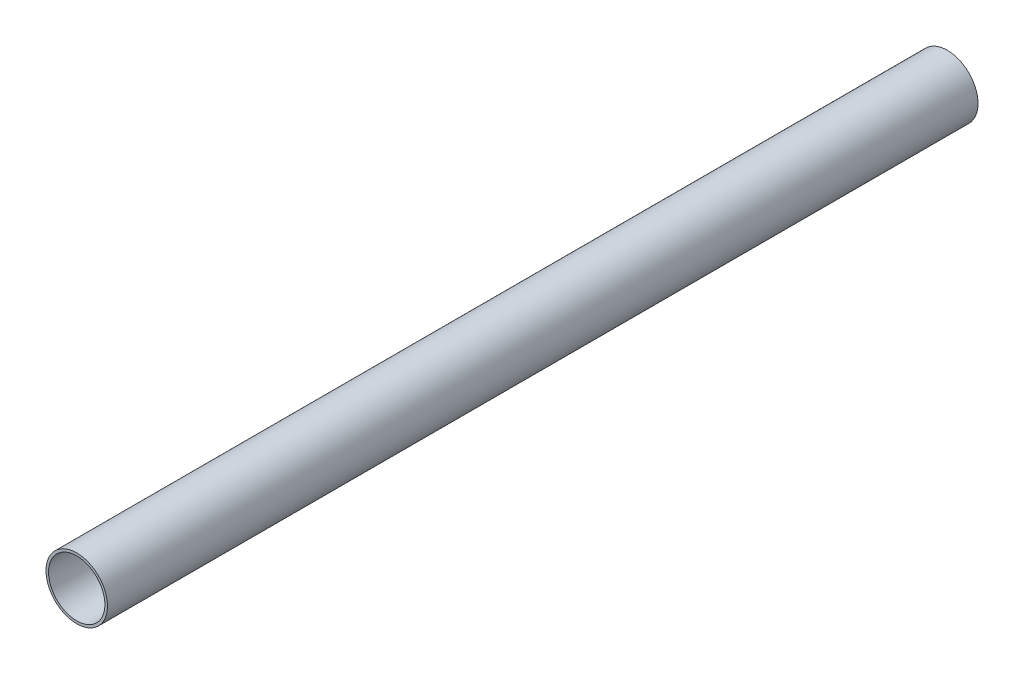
ISO-10303-21;
HEADER;
FILE_DESCRIPTION(('STEP AP214'),'2;1');
FILE_NAME('part.step','',(''),(''),'','','');
FILE_SCHEMA(('AUTOMOTIVE_DESIGN { 1 0 10303 214 1 1 1 1 }'));
ENDSEC;
DATA;
#1=APPLICATION_CONTEXT('core data for automotive mechanical design processes');
#2=APPLICATION_PROTOCOL_DEFINITION('international standard','automotive_design',2000,#1);
#3=PRODUCT_CONTEXT('',#1,'mechanical');
#4=PRODUCT('Part','Part','',(#3));
#5=PRODUCT_RELATED_PRODUCT_CATEGORY('part','',(#4));
#6=PRODUCT_DEFINITION_FORMATION('','',#4);
#7=PRODUCT_DEFINITION_CONTEXT('part definition',#1,'design');
#8=PRODUCT_DEFINITION('design','',#6,#7);
#9=PRODUCT_DEFINITION_SHAPE('','',#8);
#10=(LENGTH_UNIT() NAMED_UNIT(*) SI_UNIT(.MILLI.,.METRE.));
#11=(NAMED_UNIT(*) PLANE_ANGLE_UNIT() SI_UNIT($,.RADIAN.));
#12=(NAMED_UNIT(*) SI_UNIT($,.STERADIAN.) SOLID_ANGLE_UNIT());
#13=UNCERTAINTY_MEASURE_WITH_UNIT(LENGTH_MEASURE(1.E-05),#10,'distance_accuracy_value','');
#14=(GEOMETRIC_REPRESENTATION_CONTEXT(3) GLOBAL_UNCERTAINTY_ASSIGNED_CONTEXT((#13)) GLOBAL_UNIT_ASSIGNED_CONTEXT((#10,
#11,#12)) REPRESENTATION_CONTEXT('',''));
#15=CARTESIAN_POINT('',(0.,0.,0.));
#16=DIRECTION('',(0.,0.,1.));
#17=DIRECTION('',(1.,0.,0.));
#18=AXIS2_PLACEMENT_3D('',#15,#16,#17);
#19=CARTESIAN_POINT('',(0.,0.,425.));
#20=DIRECTION('',(0.,0.,0.999999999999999));
#21=DIRECTION('',(1.,0.,0.));
#22=AXIS2_PLACEMENT_3D('',#19,#20,#21);
#23=PLANE('',#22);
#24=CARTESIAN_POINT('',(0.,0.,425.));
#25=DIRECTION('',(0.,0.,0.999999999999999));
#26=DIRECTION('',(1.,0.,0.));
#27=AXIS2_PLACEMENT_3D('',#24,#25,#26);
#28=CIRCLE('',#27,30.);
#29=CARTESIAN_POINT('',(-30.,0.,425.));
#30=VERTEX_POINT('',#29);
#31=EDGE_CURVE('E11',#30,#30,#28,.T.);
#32=ORIENTED_EDGE('',*,*,#31,.T.);
#33=EDGE_LOOP('',(#32));
#34=FACE_BOUND('',#33,.T.);
#35=CARTESIAN_POINT('',(0.,0.,425.));
#36=DIRECTION('',(0.,0.,0.999999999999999));
#37=DIRECTION('',(1.,0.,0.));
#38=AXIS2_PLACEMENT_3D('',#35,#36,#37);
#39=CIRCLE('',#38,27.5);
#40=CARTESIAN_POINT('',(-27.5,0.,425.));
#41=VERTEX_POINT('',#40);
#42=EDGE_CURVE('E76',#41,#41,#39,.T.);
#43=ORIENTED_EDGE('',*,*,#42,.F.);
#44=EDGE_LOOP('',(#43));
#45=FACE_BOUND('',#44,.T.);
#46=ADVANCED_FACE('F62',(#34,#45),#23,.T.);
#47=CARTESIAN_POINT('',(0.,0.,-425.));
#48=DIRECTION('',(0.,0.,0.999999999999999));
#49=DIRECTION('',(1.,0.,0.));
#50=AXIS2_PLACEMENT_3D('',#47,#48,#49);
#51=PLANE('',#50);
#52=CARTESIAN_POINT('',(0.,0.,-425.));
#53=DIRECTION('',(0.,0.,0.999999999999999));
#54=DIRECTION('',(1.,0.,0.));
#55=AXIS2_PLACEMENT_3D('',#52,#53,#54);
#56=CIRCLE('',#55,30.);
#57=CARTESIAN_POINT('',(-30.,0.,-425.));
#58=VERTEX_POINT('',#57);
#59=EDGE_CURVE('E70',#58,#58,#56,.T.);
#60=ORIENTED_EDGE('',*,*,#59,.F.);
#61=EDGE_LOOP('',(#60));
#62=FACE_BOUND('',#61,.T.);
#63=CARTESIAN_POINT('',(0.,0.,-425.));
#64=DIRECTION('',(0.,0.,0.999999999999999));
#65=DIRECTION('',(1.,0.,0.));
#66=AXIS2_PLACEMENT_3D('',#63,#64,#65);
#67=CIRCLE('',#66,27.5);
#68=CARTESIAN_POINT('',(-27.5,0.,-425.));
#69=VERTEX_POINT('',#68);
#70=EDGE_CURVE('E81',#69,#69,#67,.T.);
#71=ORIENTED_EDGE('',*,*,#70,.T.);
#72=EDGE_LOOP('',(#71));
#73=FACE_BOUND('',#72,.T.);
#74=ADVANCED_FACE('F87',(#62,#73),#51,.F.);
#75=CARTESIAN_POINT('',(0.,0.,425.));
#76=DIRECTION('',(0.,0.,-0.999999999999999));
#77=DIRECTION('',(-1.,0.,0.));
#78=AXIS2_PLACEMENT_3D('',#75,#76,#77);
#79=CYLINDRICAL_SURFACE('',#78,30.);
#80=CARTESIAN_POINT('',(-30.,0.,425.));
#81=CARTESIAN_POINT('',(-30.,0.,416.145833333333));
#82=CARTESIAN_POINT('',(-30.,0.,407.291666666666));
#83=CARTESIAN_POINT('',(-30.,0.,389.583333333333));
#84=CARTESIAN_POINT('',(-30.,0.,380.729166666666));
#85=CARTESIAN_POINT('',(-30.,0.,363.020833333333));
#86=CARTESIAN_POINT('',(-30.,0.,354.166666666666));
#87=CARTESIAN_POINT('',(-30.,0.,336.458333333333));
#88=CARTESIAN_POINT('',(-30.,0.,327.604166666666));
#89=CARTESIAN_POINT('',(-30.,0.,309.895833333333));
#90=CARTESIAN_POINT('',(-30.,0.,301.041666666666));
#91=CARTESIAN_POINT('',(-30.,0.,283.333333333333));
#92=CARTESIAN_POINT('',(-30.,0.,274.479166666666));
#93=CARTESIAN_POINT('',(-30.,0.,256.770833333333));
#94=CARTESIAN_POINT('',(-30.,0.,247.916666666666));
#95=CARTESIAN_POINT('',(-30.,0.,230.208333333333));
#96=CARTESIAN_POINT('',(-30.,0.,221.354166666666));
#97=CARTESIAN_POINT('',(-30.,0.,203.645833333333));
#98=CARTESIAN_POINT('',(-30.,0.,194.791666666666));
#99=CARTESIAN_POINT('',(-30.,0.,177.083333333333));
#100=CARTESIAN_POINT('',(-30.,0.,168.229166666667));
#101=CARTESIAN_POINT('',(-30.,0.,150.520833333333));
#102=CARTESIAN_POINT('',(-30.,0.,141.666666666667));
#103=CARTESIAN_POINT('',(-30.,0.,123.958333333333));
#104=CARTESIAN_POINT('',(-30.,0.,115.104166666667));
#105=CARTESIAN_POINT('',(-30.,0.,97.3958333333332));
#106=CARTESIAN_POINT('',(-30.,0.,88.5416666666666));
#107=CARTESIAN_POINT('',(-30.,0.,70.8333333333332));
#108=CARTESIAN_POINT('',(-30.,0.,61.9791666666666));
#109=CARTESIAN_POINT('',(-30.,0.,44.2708333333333));
#110=CARTESIAN_POINT('',(-30.,0.,35.4166666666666));
#111=CARTESIAN_POINT('',(-30.,0.,17.7083333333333));
#112=CARTESIAN_POINT('',(-30.,0.,8.85416666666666));
#113=CARTESIAN_POINT('',(-30.,0.,-8.85416666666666));
#114=CARTESIAN_POINT('',(-30.,0.,-17.7083333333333));
#115=CARTESIAN_POINT('',(-30.,0.,-35.4166666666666));
#116=CARTESIAN_POINT('',(-30.,0.,-44.2708333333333));
#117=CARTESIAN_POINT('',(-30.,0.,-61.9791666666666));
#118=CARTESIAN_POINT('',(-30.,0.,-70.8333333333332));
#119=CARTESIAN_POINT('',(-30.,0.,-88.5416666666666));
#120=CARTESIAN_POINT('',(-30.,0.,-97.3958333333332));
#121=CARTESIAN_POINT('',(-30.,0.,-115.104166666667));
#122=CARTESIAN_POINT('',(-30.,0.,-123.958333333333));
#123=CARTESIAN_POINT('',(-30.,0.,-141.666666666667));
#124=CARTESIAN_POINT('',(-30.,0.,-150.520833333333));
#125=CARTESIAN_POINT('',(-30.,0.,-168.229166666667));
#126=CARTESIAN_POINT('',(-30.,0.,-177.083333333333));
#127=CARTESIAN_POINT('',(-30.,0.,-194.791666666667));
#128=CARTESIAN_POINT('',(-30.,0.,-203.645833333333));
#129=CARTESIAN_POINT('',(-30.,0.,-221.354166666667));
#130=CARTESIAN_POINT('',(-30.,0.,-230.208333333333));
#131=CARTESIAN_POINT('',(-30.,0.,-247.916666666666));
#132=CARTESIAN_POINT('',(-30.,0.,-256.770833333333));
#133=CARTESIAN_POINT('',(-30.,0.,-274.479166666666));
#134=CARTESIAN_POINT('',(-30.,0.,-283.333333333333));
#135=CARTESIAN_POINT('',(-30.,0.,-301.041666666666));
#136=CARTESIAN_POINT('',(-30.,0.,-309.895833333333));
#137=CARTESIAN_POINT('',(-30.,0.,-327.604166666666));
#138=CARTESIAN_POINT('',(-30.,0.,-336.458333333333));
#139=CARTESIAN_POINT('',(-30.,0.,-354.166666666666));
#140=CARTESIAN_POINT('',(-30.,0.,-363.020833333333));
#141=CARTESIAN_POINT('',(-30.,0.,-380.729166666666));
#142=CARTESIAN_POINT('',(-30.,0.,-389.583333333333));
#143=CARTESIAN_POINT('',(-30.,0.,-407.291666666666));
#144=CARTESIAN_POINT('',(-30.,0.,-416.145833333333));
#145=CARTESIAN_POINT('',(-30.,0.,-425.));
#146=B_SPLINE_CURVE_WITH_KNOTS('',3,(#80,#81,#82,#83,#84,#85,#86,#87,#88,#89,#90,#91,#92,#93,
#94,#95,#96,#97,#98,#99,#100,#101,#102,#103,#104,#105,#106,#107,#108,#109,#110,#111,#112,#113,
#114,#115,#116,#117,#118,#119,#120,#121,#122,#123,#124,#125,#126,#127,#128,#129,#130,#131,#132,
#133,#134,#135,#136,#137,#138,#139,#140,#141,#142,#143,#144,#145),.UNSPECIFIED.,.F.,.F.,(4,2,2,
2,2,2,2,2,2,2,2,2,2,2,2,2,2,2,2,2,2,2,2,2,2,2,2,2,2,2,2,2,4),(0.,26.5625,53.125,79.6875,106.25,
132.8125,159.375,185.9375,212.5,239.0625,265.625,292.1875,318.75,345.3125,371.875,398.4375,425.,
451.5625,478.125,504.687499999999,531.249999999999,557.8125,584.374999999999,610.937499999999,
637.5,664.062499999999,690.624999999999,717.187499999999,743.749999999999,770.312499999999,
796.874999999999,823.437499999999,849.999999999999),.UNSPECIFIED.);
#147=EDGE_CURVE('BSEAM64',#30,#58,#146,.T.);
#148=ORIENTED_EDGE('',*,*,#31,.F.);
#149=ORIENTED_EDGE('',*,*,#59,.T.);
#150=ORIENTED_EDGE('',*,*,#147,.T.);
#151=ORIENTED_EDGE('',*,*,#147,.F.);
#152=EDGE_LOOP('',(#148,#150,#149,#151));
#153=FACE_BOUND('',#152,.T.);
#154=ADVANCED_FACE('F64',(#153),#79,.T.);
#155=CARTESIAN_POINT('',(0.,0.,425.));
#156=DIRECTION('',(0.,0.,-0.999999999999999));
#157=DIRECTION('',(-1.,0.,0.));
#158=AXIS2_PLACEMENT_3D('',#155,#156,#157);
#159=CYLINDRICAL_SURFACE('',#158,27.5);
#160=CARTESIAN_POINT('',(-27.5,0.,425.));
#161=CARTESIAN_POINT('',(-27.5,0.,416.145833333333));
#162=CARTESIAN_POINT('',(-27.5,0.,407.291666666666));
#163=CARTESIAN_POINT('',(-27.5,0.,389.583333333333));
#164=CARTESIAN_POINT('',(-27.5,0.,380.729166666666));
#165=CARTESIAN_POINT('',(-27.5,0.,363.020833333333));
#166=CARTESIAN_POINT('',(-27.5,0.,354.166666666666));
#167=CARTESIAN_POINT('',(-27.5,0.,336.458333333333));
#168=CARTESIAN_POINT('',(-27.5,0.,327.604166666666));
#169=CARTESIAN_POINT('',(-27.5,0.,309.895833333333));
#170=CARTESIAN_POINT('',(-27.5,0.,301.041666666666));
#171=CARTESIAN_POINT('',(-27.5,0.,283.333333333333));
#172=CARTESIAN_POINT('',(-27.5,0.,274.479166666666));
#173=CARTESIAN_POINT('',(-27.5,0.,256.770833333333));
#174=CARTESIAN_POINT('',(-27.5,0.,247.916666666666));
#175=CARTESIAN_POINT('',(-27.5,0.,230.208333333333));
#176=CARTESIAN_POINT('',(-27.5,0.,221.354166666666));
#177=CARTESIAN_POINT('',(-27.5,0.,203.645833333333));
#178=CARTESIAN_POINT('',(-27.5,0.,194.791666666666));
#179=CARTESIAN_POINT('',(-27.5,0.,177.083333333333));
#180=CARTESIAN_POINT('',(-27.5,0.,168.229166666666));
#181=CARTESIAN_POINT('',(-27.5,0.,150.520833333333));
#182=CARTESIAN_POINT('',(-27.5,0.,141.666666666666));
#183=CARTESIAN_POINT('',(-27.5,0.,123.958333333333));
#184=CARTESIAN_POINT('',(-27.5,0.,115.104166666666));
#185=CARTESIAN_POINT('',(-27.5,0.,97.3958333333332));
#186=CARTESIAN_POINT('',(-27.5,0.,88.5416666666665));
#187=CARTESIAN_POINT('',(-27.5,0.,70.8333333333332));
#188=CARTESIAN_POINT('',(-27.5,0.,61.9791666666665));
#189=CARTESIAN_POINT('',(-27.5,0.,44.2708333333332));
#190=CARTESIAN_POINT('',(-27.5,0.,35.4166666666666));
#191=CARTESIAN_POINT('',(-27.5,0.,17.7083333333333));
#192=CARTESIAN_POINT('',(-27.5,0.,8.8541666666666));
#193=CARTESIAN_POINT('',(-27.5,0.,-8.85416666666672));
#194=CARTESIAN_POINT('',(-27.5,0.,-17.7083333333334));
#195=CARTESIAN_POINT('',(-27.5,0.,-35.4166666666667));
#196=CARTESIAN_POINT('',(-27.5,0.,-44.2708333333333));
#197=CARTESIAN_POINT('',(-27.5,0.,-61.9791666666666));
#198=CARTESIAN_POINT('',(-27.5,0.,-70.8333333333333));
#199=CARTESIAN_POINT('',(-27.5,0.,-88.5416666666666));
#200=CARTESIAN_POINT('',(-27.5,0.,-97.3958333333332));
#201=CARTESIAN_POINT('',(-27.5,0.,-115.104166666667));
#202=CARTESIAN_POINT('',(-27.5,0.,-123.958333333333));
#203=CARTESIAN_POINT('',(-27.5,0.,-141.666666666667));
#204=CARTESIAN_POINT('',(-27.5,0.,-150.520833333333));
#205=CARTESIAN_POINT('',(-27.5,0.,-168.229166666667));
#206=CARTESIAN_POINT('',(-27.5,0.,-177.083333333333));
#207=CARTESIAN_POINT('',(-27.5,0.,-194.791666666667));
#208=CARTESIAN_POINT('',(-27.5,0.,-203.645833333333));
#209=CARTESIAN_POINT('',(-27.5,0.,-221.354166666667));
#210=CARTESIAN_POINT('',(-27.5,0.,-230.208333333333));
#211=CARTESIAN_POINT('',(-27.5,0.,-247.916666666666));
#212=CARTESIAN_POINT('',(-27.5,0.,-256.770833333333));
#213=CARTESIAN_POINT('',(-27.5,0.,-274.479166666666));
#214=CARTESIAN_POINT('',(-27.5,0.,-283.333333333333));
#215=CARTESIAN_POINT('',(-27.5,0.,-301.041666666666));
#216=CARTESIAN_POINT('',(-27.5,0.,-309.895833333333));
#217=CARTESIAN_POINT('',(-27.5,0.,-327.604166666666));
#218=CARTESIAN_POINT('',(-27.5,0.,-336.458333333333));
#219=CARTESIAN_POINT('',(-27.5,0.,-354.166666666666));
#220=CARTESIAN_POINT('',(-27.5,0.,-363.020833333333));
#221=CARTESIAN_POINT('',(-27.5,0.,-380.729166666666));
#222=CARTESIAN_POINT('',(-27.5,0.,-389.583333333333));
#223=CARTESIAN_POINT('',(-27.5,0.,-407.291666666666));
#224=CARTESIAN_POINT('',(-27.5,0.,-416.145833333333));
#225=CARTESIAN_POINT('',(-27.5,0.,-425.));
#226=B_SPLINE_CURVE_WITH_KNOTS('',3,(#160,#161,#162,#163,#164,#165,#166,#167,#168,#169,#170,
#171,#172,#173,#174,#175,#176,#177,#178,#179,#180,#181,#182,#183,#184,#185,#186,#187,#188,#189,
#190,#191,#192,#193,#194,#195,#196,#197,#198,#199,#200,#201,#202,#203,#204,#205,#206,#207,#208,
#209,#210,#211,#212,#213,#214,#215,#216,#217,#218,#219,#220,#221,#222,#223,#224,#225),
.UNSPECIFIED.,.F.,.F.,(4,2,2,2,2,2,2,2,2,2,2,2,2,2,2,2,2,2,2,2,2,2,2,2,2,2,2,2,2,2,2,2,4),(0.,
26.5624999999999,53.1249999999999,79.6874999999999,106.25,132.8125,159.375,185.9375,212.5,
239.0625,265.625,292.1875,318.75,345.3125,371.875,398.4375,425.,451.5625,478.125,
504.687499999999,531.249999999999,557.8125,584.374999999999,610.937499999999,637.5,
664.062499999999,690.624999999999,717.187499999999,743.749999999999,770.312499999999,
796.874999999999,823.437499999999,849.999999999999),.UNSPECIFIED.);
#227=EDGE_CURVE('BSEAM89',#41,#69,#226,.T.);
#228=ORIENTED_EDGE('',*,*,#42,.T.);
#229=ORIENTED_EDGE('',*,*,#70,.F.);
#230=ORIENTED_EDGE('',*,*,#227,.T.);
#231=ORIENTED_EDGE('',*,*,#227,.F.);
#232=EDGE_LOOP('',(#228,#230,#229,#231));
#233=FACE_BOUND('',#232,.T.);
#234=ADVANCED_FACE('F89',(#233),#159,.F.);
#235=CLOSED_SHELL('',(#46,#74,#154,#234));
#236=MANIFOLD_SOLID_BREP('B2',#235);
#237=ADVANCED_BREP_SHAPE_REPRESENTATION('',(#18,#236),#14);
#238=SHAPE_DEFINITION_REPRESENTATION(#9,#237);
ENDSEC;
END-ISO-10303-21;
